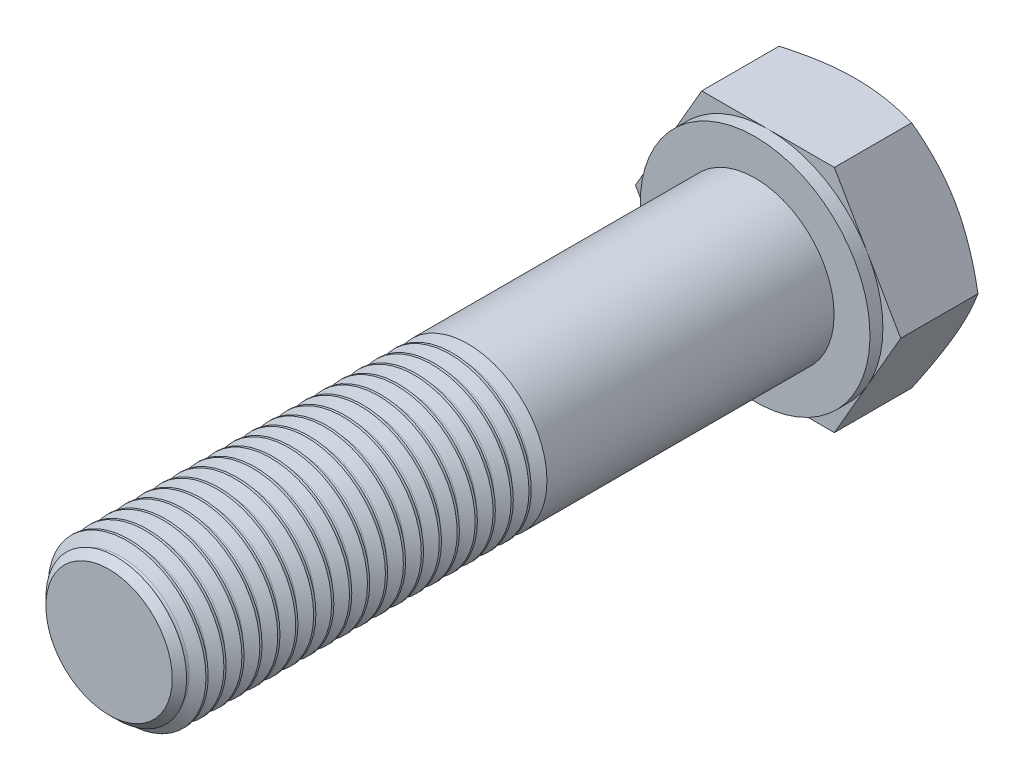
from build123d import *

# Parameters (mm, degrees)
SKETCH5_W               = 90
SKETCH5_H               = 11
THREAD_SIMPLE_COUNT     = 20
THREAD_SIMPLE_PITCH     = 2.5
SKETCH15_W              = 14
SKETCH15_H              = 22
SKETCH19_W              = 1.8
SKETCH19_H              = 6
SKETCH21_OUTSIDE_W      = 70.238
SKETCH21_OUTSIDE_H      = 70.238
CUT_PROFILE_OUTER_DEPTH = 96.226046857


with BuildPart() as part:
    # Sketch5 → body (revolve)
    with BuildSketch(Plane(origin=(0, 0, 0), x_dir=(0, 0, -1), z_dir=(1, 0, 0)), mode=Mode.PRIVATE) as body_sk:
        with Locations((-45, 5.5)):
            Rectangle(SKETCH5_W, SKETCH5_H)
    revolve(body_sk.sketch.rotate(Axis((0, 0, 90), (0, 0, -1)), 90), axis=Axis((0, 0, 90), (0, 0, -1)))

    # Sketch11 → cut-chamfer-start (revolve, cut)
    with BuildSketch(Plane(origin=(0, 0, 0), x_dir=(0, 0, -1), z_dir=(1, 0, 0)), mode=Mode.PRIVATE) as cut_chamfer_start_sk:
        Polygon((-90, -11), (-90, -8.8), (-87.8, -11), align=None)
    revolve(cut_chamfer_start_sk.sketch.rotate(Axis((0, 0, 90), (0, 0, -1)), 270), axis=Axis((0, 0, 90), (0, 0, -1)), mode=Mode.SUBTRACT)

    # Sketch8 → thread-single (revolve, cut)
    with BuildSketch(Plane(origin=(0, 0, 0), x_dir=(0, 0, -1), z_dir=(1, 0, 0)), mode=Mode.PRIVATE) as thread_single_sk:
        with BuildLine():
            Line((-42.1875, -11), (-40, -11))
            Line((-40, -11), (-40.859375, -9.511518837))
            ThreePointArc((-40.859375, -9.511518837), (-41.09375, -9.376202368), (-41.328125, -9.511518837))
            Line((-41.328125, -9.511518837), (-42.1875, -11))
        make_face()
    thread_single = revolve(thread_single_sk.sketch.rotate(Axis((0, 0, 90), (0, 0, -1)), 270), axis=Axis((0, 0, 90), (0, 0, -1)), mode=Mode.SUBTRACT)

    # thread-simple: thread-single ×20
    with Locations(*[(0, 0, i * THREAD_SIMPLE_PITCH) for i in range(1, THREAD_SIMPLE_COUNT)]):
        add(thread_single, mode=Mode.SUBTRACT)

    # Sketch15 → body-head (revolve)
    with BuildSketch(Plane(origin=(0, 0, 0), x_dir=(0, 0, -1), z_dir=(1, 0, 0)), mode=Mode.PRIVATE) as body_head_sk:
        with Locations((7, -11)):
            Rectangle(SKETCH15_W, SKETCH15_H)
    revolve(body_head_sk.sketch.rotate(Axis((0, 0, -14), (0, 0, 1)), 180), axis=Axis((0, 0, -14), (0, 0, 1)))

    # Sketch19 → cut-head-profile (revolve, cut)
    with BuildSketch(Plane(origin=(0, 0, 0), x_dir=(0, 0, -1), z_dir=(1, 0, 0)), mode=Mode.PRIVATE) as cut_head_profile_sk:
        with Locations((0.9, -19)):
            Rectangle(SKETCH19_W, SKETCH19_H)
        Polygon((14, -22), (14, -16), (10.535898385, -22), align=None)
    revolve(cut_head_profile_sk.sketch.rotate(Axis((0, 0, -14), (0, 0, 1)), 180), axis=Axis((0, 0, -14), (0, 0, 1)), mode=Mode.SUBTRACT)

    # Sketch21 outside → cut-profile-outer (cut, through all)
    with BuildSketch(Plane.XY):
        Rectangle(SKETCH21_OUTSIDE_W, SKETCH21_OUTSIDE_H)
        Polygon((18.475208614, 0), (9.237604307, 16), (-9.237604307, 16), (-18.475208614, 0), (-9.237604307, -16), (9.237604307, -16), align=None, mode=Mode.SUBTRACT)
    extrude(amount=-CUT_PROFILE_OUTER_DEPTH, mode=Mode.SUBTRACT)


solid = part.part
